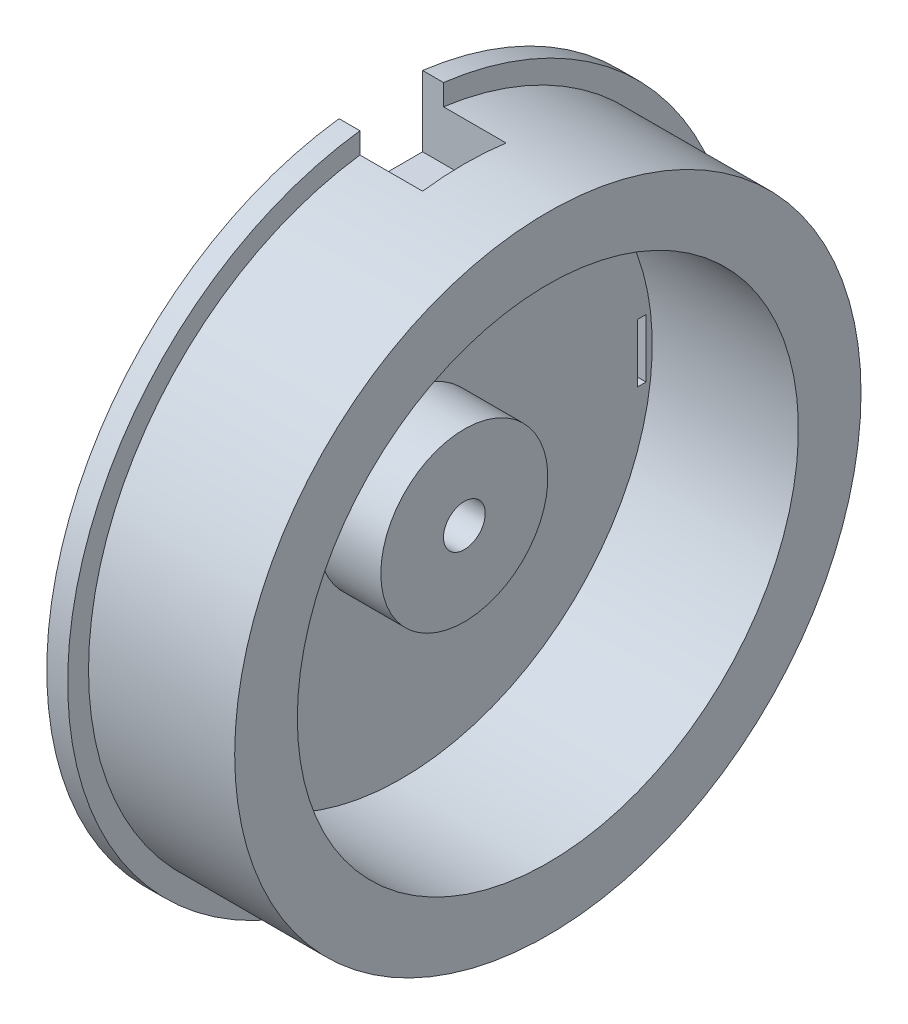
from build123d import *

# Parameters (mm, degrees)
ENL_V_START                  = -4
ENL_V_MAT_EXTRU_1_DEPTH      = 4
R_P_TITION_CIRCULAIRE1_COUNT = 2
ESQUISSE3_W                  = 0.4
ESQUISSE3_H                  = 2.8
ENL_V_MAT_EXTRU_2_DEPTH      = 24.916521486
R_P_TITION_CIRCULAIRE2_COUNT = 2


with BuildPart() as part:
    # Esquisse1 → Base-R_volution (revolve)
    with BuildSketch(Plane.XY, mode=Mode.PRIVATE) as base_r_volution_sk:
        Polygon((0, 4), (0, 16), (1, 16), (1, 15), (8, 15), (8, 12), (1, 12), (1, 4), (4, 4), (4, 1), (-1, 1), (-1, 4), align=None)
    revolve(base_r_volution_sk.sketch.rotate(Axis((0, 0, 0), (1, 0, 0)), 90), axis=Axis((0, 0, 0), (1, 0, 0)))

    # Esquisse2 → Enl_v. mat.-Extru.1 (cut)
    with BuildSketch(Plane.ZY.offset(ENL_V_START)):
        with BuildLine():
            Line((-2, 15.874507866), (-2, 12.5))
            Line((-2, 12.5), (2, 12.5))
            Line((2, 12.5), (2, 15.874507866))
            ThreePointArc((2, 15.874507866), (0, 16), (-2, 15.874507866))
        make_face()
    enl_v_mat_extru_1 = extrude(amount=ENL_V_MAT_EXTRU_1_DEPTH, mode=Mode.SUBTRACT)

    # R_p_tition circulaire1: Enl_v. mat.-Extru.1 ×2 about axis
    r_p_tition_circulaire1_axis = Axis((0, 0, 0), (1, 0, 0))
    for i in range(1, R_P_TITION_CIRCULAIRE1_COUNT):
        add(enl_v_mat_extru_1.rotate(r_p_tition_circulaire1_axis, i * 360 / R_P_TITION_CIRCULAIRE1_COUNT), mode=Mode.SUBTRACT)

    # Esquisse3 → Enl_v. mat.-Extru.2 (cut, through all)
    with BuildSketch(Plane.ZY):
        with Locations((11.5, 0)):
            Rectangle(ESQUISSE3_W, ESQUISSE3_H)
    enl_v_mat_extru_2 = extrude(amount=-ENL_V_MAT_EXTRU_2_DEPTH, mode=Mode.SUBTRACT)

    # R_p_tition circulaire2: Enl_v. mat.-Extru.2 ×2 about axis
    r_p_tition_circulaire2_axis = Axis((0, 0, 0), (1, 0, 0))
    for i in range(1, R_P_TITION_CIRCULAIRE2_COUNT):
        add(enl_v_mat_extru_2.rotate(r_p_tition_circulaire2_axis, i * 360 / R_P_TITION_CIRCULAIRE2_COUNT), mode=Mode.SUBTRACT)


solid = part.part
